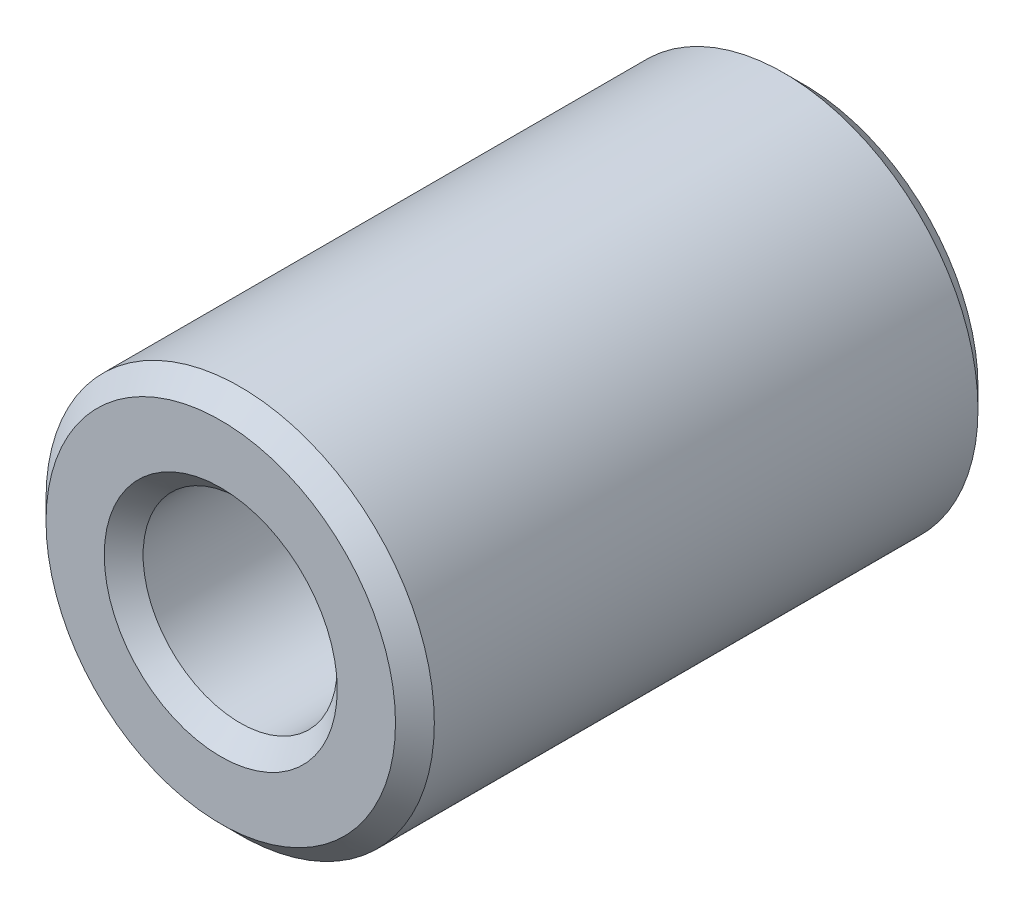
from build123d import *

# Parameters (mm, degrees)
ESQUISSE1_R   = 5
ESQUISSE1_R_2 = 2.5
CORPS_DEPTH   = 15
CHANF_SIZE    = 0.5


with BuildPart() as part:
    # Esquisse1 → Corps (new body)
    with BuildSketch(Plane.XY):
        Circle(ESQUISSE1_R)
        Circle(ESQUISSE1_R_2, mode=Mode.SUBTRACT)
    extrude(amount=-CORPS_DEPTH)

    # Chanf
    chanf_edges = [part.edges().sort_by_distance(p)[0] for p in [
        (-5, 0, 0),
        (-5, 0, -15),
        (-2.5, 0, 0),
        (-2.5, 0, -15),
    ]]
    chamfer(chanf_edges, length=CHANF_SIZE)


solid = part.part
